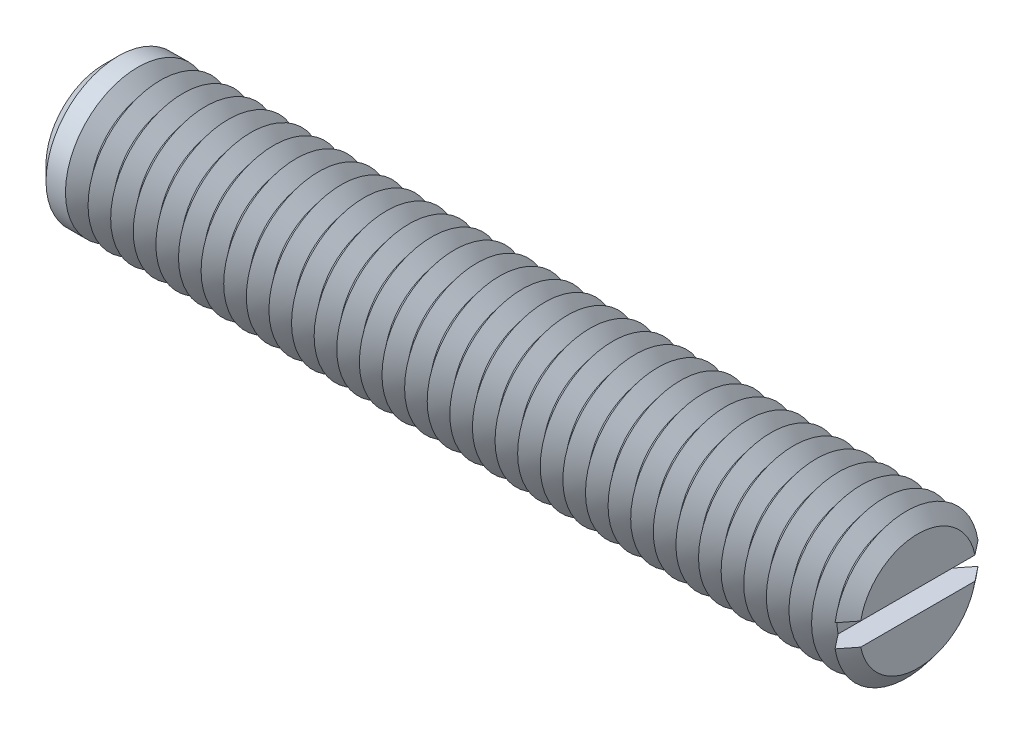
from build123d import *

# Parameters (mm, degrees)
SKETCH1_R       = 4
EXTRUDE1_DEPTH  = 22.5
SKETCH2_W       = 1.25
SKETCH2_H       = 1.25
EXTRUDE2_DEPTH  = 6
CHAMFER1_SIZE   = 0.8
LPATTERN1_COUNT = 35
LPATTERN1_PITCH = 1.25


with BuildPart() as part:
    # Sketch1 → Extrude1 (new, symmetric)
    with BuildSketch(Plane(origin=(0, 0, 0), x_dir=(0, 0, -1), z_dir=(1, 0, 0))):
        with Locations(Location((0, 0, 0), (0, 0, 180))):
            Circle(SKETCH1_R)
    extrude(amount=EXTRUDE1_DEPTH, both=True)

    # Sketch2 → Extrude2 (cut, symmetric)
    with BuildSketch(Plane.XY):
        with Locations((21.875, 0)):
            Rectangle(SKETCH2_W, SKETCH2_H)
    extrude(amount=EXTRUDE2_DEPTH, both=True, mode=Mode.SUBTRACT)

    # Chamfer1
    chamfer1_edges = [part.edges().sort_by_distance(p)[0] for p in [
        (-22.5, 0, -4),
    ]]
    chamfer(chamfer1_edges, length=CHAMFER1_SIZE)

    # Sketch3 → Cut-Revolve1 (revolve, cut)
    with BuildSketch(Plane.XY, mode=Mode.PRIVATE) as cut_revolve1_sk:
        Polygon((21.875, -4), (23.125, -4), (22.5, -3.21937525), align=None)
    cut_revolve1 = revolve(cut_revolve1_sk.sketch.rotate(Axis((0, 0, 0), (1, 0, 0)), 278.989299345), axis=Axis((0, 0, 0), (1, 0, 0)), mode=Mode.SUBTRACT)

    # LPattern1: Cut-Revolve1 ×35
    with Locations(*[(-i * LPATTERN1_PITCH, 0, 0) for i in range(1, LPATTERN1_COUNT)]):
        add(cut_revolve1, mode=Mode.SUBTRACT)


solid = part.part
